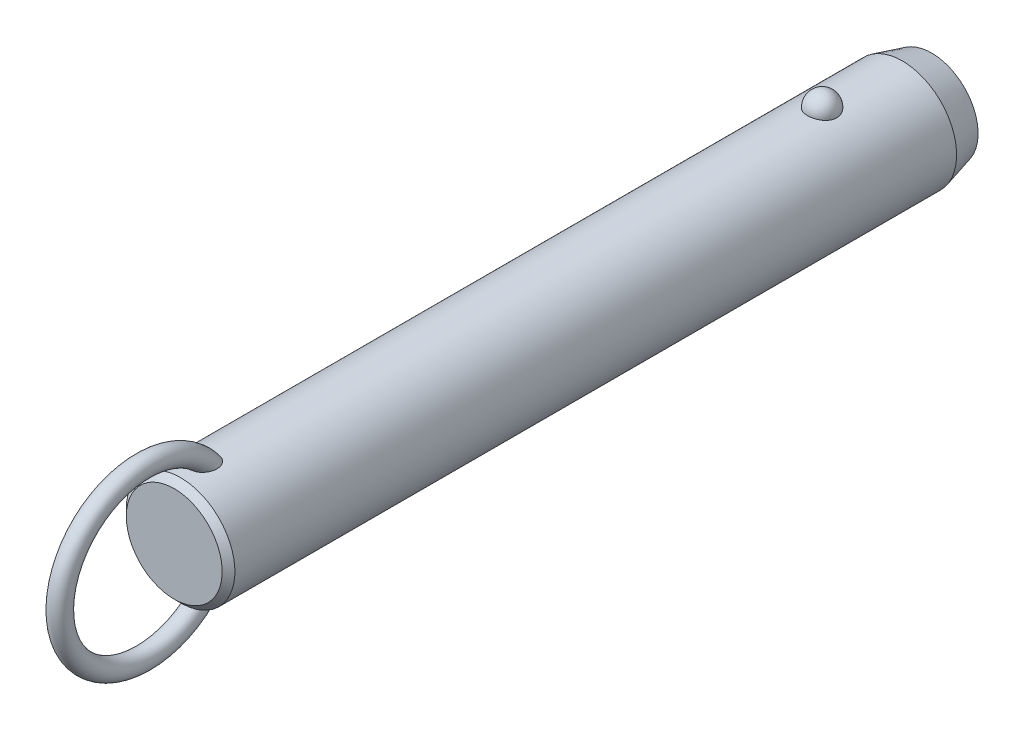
ISO-10303-21;
HEADER;
FILE_DESCRIPTION(('STEP AP214'),'2;1');
FILE_NAME('part.step','',(''),(''),'','','');
FILE_SCHEMA(('AUTOMOTIVE_DESIGN { 1 0 10303 214 1 1 1 1 }'));
ENDSEC;
DATA;
#1=APPLICATION_CONTEXT('core data for automotive mechanical design processes');
#2=APPLICATION_PROTOCOL_DEFINITION('international standard','automotive_design',2000,#1);
#3=PRODUCT_CONTEXT('',#1,'mechanical');
#4=PRODUCT('Part','Part','',(#3));
#5=PRODUCT_RELATED_PRODUCT_CATEGORY('part','',(#4));
#6=PRODUCT_DEFINITION_FORMATION('','',#4);
#7=PRODUCT_DEFINITION_CONTEXT('part definition',#1,'design');
#8=PRODUCT_DEFINITION('design','',#6,#7);
#9=PRODUCT_DEFINITION_SHAPE('','',#8);
#10=(LENGTH_UNIT() NAMED_UNIT(*) SI_UNIT(.MILLI.,.METRE.));
#11=(NAMED_UNIT(*) PLANE_ANGLE_UNIT() SI_UNIT($,.RADIAN.));
#12=(NAMED_UNIT(*) SI_UNIT($,.STERADIAN.) SOLID_ANGLE_UNIT());
#13=UNCERTAINTY_MEASURE_WITH_UNIT(LENGTH_MEASURE(1.E-05),#10,'distance_accuracy_value','');
#14=(GEOMETRIC_REPRESENTATION_CONTEXT(3) GLOBAL_UNCERTAINTY_ASSIGNED_CONTEXT((#13)) GLOBAL_UNIT_ASSIGNED_CONTEXT((#10,
#11,#12)) REPRESENTATION_CONTEXT('',''));
#15=CARTESIAN_POINT('',(0.,0.,0.));
#16=DIRECTION('',(0.,0.,1.));
#17=DIRECTION('',(1.,0.,0.));
#18=AXIS2_PLACEMENT_3D('',#15,#16,#17);
#19=CARTESIAN_POINT('',(0.,0.,116.8));
#20=DIRECTION('',(0.,0.,-1.));
#21=DIRECTION('',(-1.,0.,0.));
#22=AXIS2_PLACEMENT_3D('',#19,#20,#21);
#23=CYLINDRICAL_SURFACE('',#22,11.1);
#24=CARTESIAN_POINT('',(2.9724815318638,10.6945945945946,-3.));
#25=CARTESIAN_POINT('',(2.97247830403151,10.6945972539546,-2.83225059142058));
#26=CARTESIAN_POINT('',(2.95876598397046,10.6984356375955,-2.66445972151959));
#27=CARTESIAN_POINT('',(2.90424529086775,10.7133624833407,-2.33362381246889));
#28=CARTESIAN_POINT('',(2.8634252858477,10.7244540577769,-2.1705808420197));
#29=CARTESIAN_POINT('',(2.75573657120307,10.7526272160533,-1.85396767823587));
#30=CARTESIAN_POINT('',(2.68887937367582,10.7697061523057,-1.70039333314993));
#31=CARTESIAN_POINT('',(2.53079696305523,10.8079438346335,-1.40691598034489));
#32=CARTESIAN_POINT('',(2.43957264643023,10.8291024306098,-1.2670124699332));
#33=CARTESIAN_POINT('',(2.23458150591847,10.8732541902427,-1.00409565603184));
#34=CARTESIAN_POINT('',(2.12071295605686,10.8962553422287,-0.881162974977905));
#35=CARTESIAN_POINT('',(1.87365402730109,10.9414421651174,-0.656352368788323));
#36=CARTESIAN_POINT('',(1.74046358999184,10.9636278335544,-0.554474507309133));
#37=CARTESIAN_POINT('',(1.45872188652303,11.0046495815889,-0.374872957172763));
#38=CARTESIAN_POINT('',(1.31021276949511,11.0234944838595,-0.297085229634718));
#39=CARTESIAN_POINT('',(1.00170030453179,11.0557957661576,-0.167529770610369));
#40=CARTESIAN_POINT('',(0.841698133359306,11.0692526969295,-0.115759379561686));
#41=CARTESIAN_POINT('',(0.517607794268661,11.0890932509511,-0.0403925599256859));
#42=CARTESIAN_POINT('',(0.353633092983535,11.0955916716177,-0.0163383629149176));
#43=CARTESIAN_POINT('',(0.0238420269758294,11.1011989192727,0.0044517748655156));
#44=CARTESIAN_POINT('',(-0.141974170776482,11.1003084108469,0.00119017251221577));
#45=CARTESIAN_POINT('',(-0.468405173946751,11.0912990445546,-0.0323233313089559));
#46=CARTESIAN_POINT('',(-0.629059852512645,11.0832767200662,-0.0622147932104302));
#47=CARTESIAN_POINT('',(-0.942937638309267,11.0609962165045,-0.147645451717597));
#48=CARTESIAN_POINT('',(-1.09616062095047,11.0467379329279,-0.203185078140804));
#49=CARTESIAN_POINT('',(-1.39181061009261,11.0134071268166,-0.3387529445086));
#50=CARTESIAN_POINT('',(-1.53417383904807,10.9943086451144,-0.418913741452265));
#51=CARTESIAN_POINT('',(-1.80342160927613,10.9533667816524,-0.60144882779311));
#52=CARTESIAN_POINT('',(-1.9303046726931,10.9315231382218,-0.703825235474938));
#53=CARTESIAN_POINT('',(-2.16747598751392,10.887005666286,-0.930091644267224));
#54=CARTESIAN_POINT('',(-2.27742774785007,10.8643239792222,-1.05433291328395));
#55=CARTESIAN_POINT('',(-2.47517316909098,10.8209886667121,-1.31966633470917));
#56=CARTESIAN_POINT('',(-2.56296538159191,10.8003351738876,-1.46075958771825));
#57=CARTESIAN_POINT('',(-2.71500300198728,10.7631304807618,-1.75753646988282));
#58=CARTESIAN_POINT('',(-2.77898901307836,10.7466250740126,-1.91335887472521));
#59=CARTESIAN_POINT('',(-2.88046189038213,10.7198747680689,-2.2339152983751));
#60=CARTESIAN_POINT('',(-2.91794947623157,10.709629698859,-2.39864907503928));
#61=CARTESIAN_POINT('',(-2.96537819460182,10.6965949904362,-2.73165170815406));
#62=CARTESIAN_POINT('',(-2.97542891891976,10.693775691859,-2.89990378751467));
#63=CARTESIAN_POINT('',(-2.96804271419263,10.6958279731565,-3.235752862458));
#64=CARTESIAN_POINT('',(-2.95060646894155,10.7006993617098,-3.40334987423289));
#65=CARTESIAN_POINT('',(-2.88883358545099,10.71753912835,-3.73233906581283));
#66=CARTESIAN_POINT('',(-2.84462026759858,10.7294749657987,-3.89375610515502));
#67=CARTESIAN_POINT('',(-2.73050447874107,10.7590797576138,-4.20667949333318));
#68=CARTESIAN_POINT('',(-2.66060103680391,10.7767489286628,-4.35818546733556));
#69=CARTESIAN_POINT('',(-2.49642559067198,10.8159599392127,-4.6478542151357));
#70=CARTESIAN_POINT('',(-2.40203047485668,10.8375211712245,-4.78594458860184));
#71=CARTESIAN_POINT('',(-2.19143488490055,10.8820570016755,-5.0441038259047));
#72=CARTESIAN_POINT('',(-2.07523364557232,10.9050316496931,-5.16417205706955));
#73=CARTESIAN_POINT('',(-1.82361254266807,10.9499219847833,-5.38334833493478));
#74=CARTESIAN_POINT('',(-1.68812945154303,10.9718338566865,-5.48238464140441));
#75=CARTESIAN_POINT('',(-1.40191298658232,11.0120611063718,-5.65618873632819));
#76=CARTESIAN_POINT('',(-1.25118062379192,11.0303767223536,-5.73095813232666));
#77=CARTESIAN_POINT('',(-0.940570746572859,11.0611653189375,-5.85334725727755));
#78=CARTESIAN_POINT('',(-0.780821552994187,11.0737044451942,-5.90127578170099));
#79=CARTESIAN_POINT('',(-0.455204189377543,11.0918598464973,-5.96992976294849));
#80=CARTESIAN_POINT('',(-0.289336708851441,11.0974768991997,-5.99065827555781));
#81=CARTESIAN_POINT('',(0.0406846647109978,11.1011307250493,-6.00418773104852));
#82=CARTESIAN_POINT('',(0.204817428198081,11.099299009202,-5.99747318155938));
#83=CARTESIAN_POINT('',(0.5295530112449,11.088551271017,-5.9574031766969));
#84=CARTESIAN_POINT('',(0.69015594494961,11.0796354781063,-5.92404858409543));
#85=CARTESIAN_POINT('',(1.0027760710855,11.0557204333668,-5.83180084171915));
#86=CARTESIAN_POINT('',(1.15482001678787,11.0407414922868,-5.77299291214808));
#87=CARTESIAN_POINT('',(1.44678373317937,11.0062913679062,-5.63147366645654));
#88=CARTESIAN_POINT('',(1.58670279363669,10.9868199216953,-5.54876095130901));
#89=CARTESIAN_POINT('',(1.8527023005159,10.9451315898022,-5.36027644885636));
#90=CARTESIAN_POINT('',(1.97855158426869,10.9228788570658,-5.25418644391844));
#91=CARTESIAN_POINT('',(2.21080872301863,10.8782509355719,-5.02251354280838));
#92=CARTESIAN_POINT('',(2.31721312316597,10.8558757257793,-4.89692718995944));
#93=CARTESIAN_POINT('',(2.5094551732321,10.8130715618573,-4.62745408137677));
#94=CARTESIAN_POINT('',(2.59493284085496,10.7926798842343,-4.48330448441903));
#95=CARTESIAN_POINT('',(2.740862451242,10.7565495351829,-4.18236358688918));
#96=CARTESIAN_POINT('',(2.80132490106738,10.7408089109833,-4.02557762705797));
#97=CARTESIAN_POINT('',(2.88959070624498,10.7173718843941,-3.72475308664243));
#98=CARTESIAN_POINT('',(2.92062102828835,10.7088950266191,-3.58171216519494));
#99=CARTESIAN_POINT('',(2.96206765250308,10.6975052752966,-3.29245795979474));
#100=CARTESIAN_POINT('',(2.97248434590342,10.6945922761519,-3.14624473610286));
#101=CARTESIAN_POINT('',(2.9724815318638,10.6945945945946,-3.));
#102=B_SPLINE_CURVE_WITH_KNOTS('',3,(#24,#25,#26,#27,#28,#29,#30,#31,#32,#33,#34,#35,#36,#37,
#38,#39,#40,#41,#42,#43,#44,#45,#46,#47,#48,#49,#50,#51,#52,#53,#54,#55,#56,#57,#58,#59,#60,#61,
#62,#63,#64,#65,#66,#67,#68,#69,#70,#71,#72,#73,#74,#75,#76,#77,#78,#79,#80,#81,#82,#83,#84,#85,
#86,#87,#88,#89,#90,#91,#92,#93,#94,#95,#96,#97,#98,#99,#100,#101),.UNSPECIFIED.,.T.,.F.,(4,2,2,
2,2,2,2,2,2,2,2,2,2,2,2,2,2,2,2,2,2,2,2,2,2,2,2,2,2,2,2,2,2,2,2,2,2,2,4),(0.,0.502722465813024,
1.00566079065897,1.5083769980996,2.01107471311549,2.51608392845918,3.02109467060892,
3.52475118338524,4.02835620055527,4.523518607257,5.0186364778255,5.50715297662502,
5.9956776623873,6.48688002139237,6.97812923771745,7.47814366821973,7.9781907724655,
8.48353712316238,8.9888697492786,9.49218093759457,9.99547960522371,10.4964777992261,
10.997494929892,11.5010810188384,12.0046847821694,12.5099796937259,13.0152411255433,
13.5145635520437,14.0138298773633,14.5043200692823,14.9947943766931,15.4836390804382,
15.9725123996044,16.4685040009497,16.9645836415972,17.4686765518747,17.972557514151,
18.410841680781,18.849117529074),.UNSPECIFIED.);
#103=CARTESIAN_POINT('',(2.9724815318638,10.6945945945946,-3.));
#104=VERTEX_POINT('',#103);
#105=EDGE_CURVE('E41',#104,#104,#102,.T.);
#106=ORIENTED_EDGE('',*,*,#105,.T.);
#107=EDGE_LOOP('',(#106));
#108=FACE_BOUND('',#107,.T.);
#109=CARTESIAN_POINT('',(0.,0.,128.2));
#110=DIRECTION('',(0.,0.,1.));
#111=DIRECTION('',(1.,0.,0.));
#112=AXIS2_PLACEMENT_3D('',#109,#110,#111);
#113=CIRCLE('',#112,11.1);
#114=CARTESIAN_POINT('',(-11.1,0.,128.2));
#115=VERTEX_POINT('',#114);
#116=EDGE_CURVE('E10',#115,#115,#113,.F.);
#117=ORIENTED_EDGE('',*,*,#116,.T.);
#118=EDGE_LOOP('',(#117));
#119=FACE_BOUND('',#118,.T.);
#120=CARTESIAN_POINT('',(-0.564520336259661,-11.0856356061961,120.457815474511));
#121=CARTESIAN_POINT('',(-0.66720283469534,-11.0804062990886,120.491283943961));
#122=CARTESIAN_POINT('',(-0.766875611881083,-11.0738877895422,120.533835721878));
#123=CARTESIAN_POINT('',(-0.957284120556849,-11.0590576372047,120.635419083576));
#124=CARTESIAN_POINT('',(-1.04801616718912,-11.0507452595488,120.69445742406));
#125=CARTESIAN_POINT('',(-1.21800952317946,-11.0333016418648,120.826529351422));
#126=CARTESIAN_POINT('',(-1.29730805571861,-11.0241732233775,120.899515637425));
#127=CARTESIAN_POINT('',(-1.44337665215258,-11.0060026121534,121.057037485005));
#128=CARTESIAN_POINT('',(-1.51014622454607,-10.9969604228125,121.141573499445));
#129=CARTESIAN_POINT('',(-1.63454620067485,-10.9791841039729,121.325521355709));
#130=CARTESIAN_POINT('',(-1.69127003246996,-10.9705107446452,121.425549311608));
#131=CARTESIAN_POINT('',(-1.78980785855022,-10.9548648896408,121.632790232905));
#132=CARTESIAN_POINT('',(-1.83161214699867,-10.9478935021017,121.740007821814));
#133=CARTESIAN_POINT('',(-1.91557028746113,-10.9335803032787,122.005408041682));
#134=CARTESIAN_POINT('',(-1.95040620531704,-10.9273269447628,122.165980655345));
#135=CARTESIAN_POINT('',(-1.99388326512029,-10.9194709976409,122.490697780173));
#136=CARTESIAN_POINT('',(-2.00248051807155,-10.9178762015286,122.654847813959));
#137=CARTESIAN_POINT('',(-1.99551615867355,-10.9191578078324,123.024650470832));
#138=CARTESIAN_POINT('',(-1.9732206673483,-10.9232807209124,123.230191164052));
#139=CARTESIAN_POINT('',(-1.9152976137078,-10.9335244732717,123.533595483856));
#140=CARTESIAN_POINT('',(-1.8918457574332,-10.9376266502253,123.634088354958));
#141=CARTESIAN_POINT('',(-1.83700674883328,-10.9469720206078,123.832855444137));
#142=CARTESIAN_POINT('',(-1.80562070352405,-10.9522150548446,123.931129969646));
#143=CARTESIAN_POINT('',(-1.73463055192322,-10.9636837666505,124.125914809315));
#144=CARTESIAN_POINT('',(-1.6949341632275,-10.9699202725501,124.222390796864));
#145=CARTESIAN_POINT('',(-1.6074514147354,-10.9830806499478,124.411626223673));
#146=CARTESIAN_POINT('',(-1.55966150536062,-10.9900048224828,124.504384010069));
#147=CARTESIAN_POINT('',(-1.45591812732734,-11.0042280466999,124.684690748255));
#148=CARTESIAN_POINT('',(-1.40000013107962,-11.0115253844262,124.772260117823));
#149=CARTESIAN_POINT('',(-1.2793747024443,-11.0261911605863,124.941029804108));
#150=CARTESIAN_POINT('',(-1.21467835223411,-11.0335594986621,125.02223795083));
#151=CARTESIAN_POINT('',(-1.08218150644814,-11.0473027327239,125.169001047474));
#152=CARTESIAN_POINT('',(-1.01522633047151,-11.0537063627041,125.235309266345));
#153=CARTESIAN_POINT('',(-0.872952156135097,-11.065850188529,125.358378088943));
#154=CARTESIAN_POINT('',(-0.797642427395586,-11.0715911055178,125.415149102));
#155=CARTESIAN_POINT('',(-0.651396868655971,-11.081071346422,125.507515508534));
#156=CARTESIAN_POINT('',(-0.581712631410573,-11.0849841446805,125.545049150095));
#157=CARTESIAN_POINT('',(-0.437066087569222,-11.0916271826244,125.608259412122));
#158=CARTESIAN_POINT('',(-0.362109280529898,-11.0943586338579,125.633948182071));
#159=CARTESIAN_POINT('',(-0.207828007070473,-11.0983242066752,125.671117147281));
#160=CARTESIAN_POINT('',(-0.128467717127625,-11.0995432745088,125.682454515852));
#161=CARTESIAN_POINT('',(0.03091017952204,-11.1002423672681,125.688965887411));
#162=CARTESIAN_POINT('',(0.11092739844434,-11.0997233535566,125.684148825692));
#163=CARTESIAN_POINT('',(0.256406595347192,-11.097240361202,125.660959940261));
#164=CARTESIAN_POINT('',(0.322235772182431,-11.0955074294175,125.644754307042));
#165=CARTESIAN_POINT('',(0.450635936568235,-11.0910350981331,125.602600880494));
#166=CARTESIAN_POINT('',(0.513205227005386,-11.0882951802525,125.576648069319));
#167=CARTESIAN_POINT('',(0.662626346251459,-11.0805620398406,125.502607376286));
#168=CARTESIAN_POINT('',(0.747127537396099,-11.0751144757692,125.449845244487));
#169=CARTESIAN_POINT('',(0.906756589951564,-11.0631932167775,125.331720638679));
#170=CARTESIAN_POINT('',(0.981859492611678,-11.0567168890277,125.266325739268));
#171=CARTESIAN_POINT('',(1.10712207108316,-11.0447856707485,125.14226337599));
#172=CARTESIAN_POINT('',(1.15909566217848,-11.0394280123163,125.085383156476));
#173=CARTESIAN_POINT('',(1.25791923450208,-11.0286040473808,124.967327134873));
#174=CARTESIAN_POINT('',(1.30476642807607,-11.0231376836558,124.906149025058));
#175=CARTESIAN_POINT('',(1.43818612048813,-11.0068027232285,124.717305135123));
#176=CARTESIAN_POINT('',(1.51751767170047,-10.9960104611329,124.584453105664));
#177=CARTESIAN_POINT('',(1.63597546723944,-10.9788847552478,124.353137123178));
#178=CARTESIAN_POINT('',(1.67988876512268,-10.9722190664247,124.257053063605));
#179=CARTESIAN_POINT('',(1.75953241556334,-10.9597298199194,124.061431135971));
#180=CARTESIAN_POINT('',(1.79525967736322,-10.9539065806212,123.961891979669));
#181=CARTESIAN_POINT('',(1.85844731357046,-10.9433632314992,123.76021118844));
#182=CARTESIAN_POINT('',(1.88591073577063,-10.9386427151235,123.65807052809));
#183=CARTESIAN_POINT('',(1.93234324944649,-10.9305350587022,123.451819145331));
#184=CARTESIAN_POINT('',(1.95131065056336,-10.9271481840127,123.347708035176));
#185=CARTESIAN_POINT('',(1.99040203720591,-10.9201183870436,123.065458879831));
#186=CARTESIAN_POINT('',(2.00221217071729,-10.9179256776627,122.886037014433));
#187=CARTESIAN_POINT('',(1.99711676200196,-10.9188636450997,122.527713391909));
#188=CARTESIAN_POINT('',(1.98026150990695,-10.9219849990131,122.348811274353));
#189=CARTESIAN_POINT('',(1.92151657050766,-10.9324473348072,122.03645144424));
#190=CARTESIAN_POINT('',(1.88605081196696,-10.9386915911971,121.901759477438));
#191=CARTESIAN_POINT('',(1.79393020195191,-10.9541780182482,121.639966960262));
#192=CARTESIAN_POINT('',(1.73729868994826,-10.9634168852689,121.512858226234));
#193=CARTESIAN_POINT('',(1.612370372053,-10.9824218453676,121.289418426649));
#194=CARTESIAN_POINT('',(1.54715374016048,-10.9918945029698,121.191345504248));
#195=CARTESIAN_POINT('',(1.40127026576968,-11.0114415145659,121.007434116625));
#196=CARTESIAN_POINT('',(1.32060742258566,-11.0215157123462,120.921592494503));
#197=CARTESIAN_POINT('',(1.14474787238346,-11.041168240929,120.765163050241));
#198=CARTESIAN_POINT('',(1.04947805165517,-11.0507437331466,120.694656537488));
#199=CARTESIAN_POINT('',(0.847278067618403,-11.0680789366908,120.572640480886));
#200=CARTESIAN_POINT('',(0.74035174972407,-11.0758392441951,120.521124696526));
#201=CARTESIAN_POINT('',(0.529289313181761,-11.0878275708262,120.443485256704));
#202=CARTESIAN_POINT('',(0.425895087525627,-11.0923259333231,120.415377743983));
#203=CARTESIAN_POINT('',(0.215723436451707,-11.0984001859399,120.377703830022));
#204=CARTESIAN_POINT('',(0.108947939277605,-11.0999777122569,120.368127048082));
#205=CARTESIAN_POINT('',(-0.093896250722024,-11.1000196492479,120.367877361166));
#206=CARTESIAN_POINT('',(-0.189967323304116,-11.0987797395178,120.375408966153));
#207=CARTESIAN_POINT('',(-0.379657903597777,-11.0939111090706,120.405507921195));
#208=CARTESIAN_POINT('',(-0.473277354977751,-11.0902823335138,120.428075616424));
#209=CARTESIAN_POINT('',(-0.564520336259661,-11.0856356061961,120.457815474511));
#210=B_SPLINE_CURVE_WITH_KNOTS('',3,(#120,#121,#122,#123,#124,#125,#126,#127,#128,#129,#130,
#131,#132,#133,#134,#135,#136,#137,#138,#139,#140,#141,#142,#143,#144,#145,#146,#147,#148,#149,
#150,#151,#152,#153,#154,#155,#156,#157,#158,#159,#160,#161,#162,#163,#164,#165,#166,#167,#168,
#169,#170,#171,#172,#173,#174,#175,#176,#177,#178,#179,#180,#181,#182,#183,#184,#185,#186,#187,
#188,#189,#190,#191,#192,#193,#194,#195,#196,#197,#198,#199,#200,#201,#202,#203,#204,#205,#206,
#207,#208,#209),.UNSPECIFIED.,.T.,.F.,(4,2,2,2,2,2,2,2,2,2,2,2,2,2,2,2,2,2,2,2,2,2,2,2,2,2,2,2,
2,2,2,2,2,2,2,2,2,2,2,2,2,2,2,2,4),(0.,0.323999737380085,0.648132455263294,0.971184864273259,
1.2942499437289,1.6388623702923,1.98369857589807,2.47426059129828,2.96564271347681,
3.58257396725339,3.89215258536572,4.201688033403,4.51486273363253,4.82817514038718,
5.14015911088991,5.45175282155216,5.73442856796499,6.01679375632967,6.2536458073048,
6.49025437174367,6.72919963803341,6.96801276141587,7.17061258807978,7.37331685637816,
7.67094989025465,7.96935728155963,8.20075067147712,8.43226927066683,8.89581623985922,
9.21306533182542,9.530434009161,9.84768549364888,10.1650000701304,10.70229304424,
11.2386443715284,11.6553390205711,12.0715755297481,12.4245637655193,12.7774607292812,
13.1321855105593,13.4867936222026,13.8068771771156,14.1267813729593,14.4146787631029,
14.7025827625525),.UNSPECIFIED.);
#211=CARTESIAN_POINT('',(-0.564520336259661,-11.0856356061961,120.457815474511));
#212=VERTEX_POINT('',#211);
#213=EDGE_CURVE('E60',#212,#212,#210,.T.);
#214=ORIENTED_EDGE('',*,*,#213,.T.);
#215=EDGE_LOOP('',(#214));
#216=FACE_BOUND('',#215,.T.);
#217=CARTESIAN_POINT('',(-0.564520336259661,11.0856356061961,120.457815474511));
#218=CARTESIAN_POINT('',(-0.468542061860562,11.0905203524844,120.426545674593));
#219=CARTESIAN_POINT('',(-0.36979381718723,11.0942886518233,120.403157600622));
#220=CARTESIAN_POINT('',(-0.169555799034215,11.0991586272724,120.373085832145));
#221=CARTESIAN_POINT('',(-0.0680604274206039,11.1002543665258,120.36643932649));
#222=CARTESIAN_POINT('',(0.134549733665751,11.099646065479,120.370157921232));
#223=CARTESIAN_POINT('',(0.235664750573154,11.0979441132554,120.38051033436));
#224=CARTESIAN_POINT('',(0.434632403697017,11.0919342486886,120.417831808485));
#225=CARTESIAN_POINT('',(0.532486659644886,11.0876276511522,120.444792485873));
#226=CARTESIAN_POINT('',(0.722445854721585,11.0768742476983,120.5144096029));
#227=CARTESIAN_POINT('',(0.814543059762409,11.0704246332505,120.557086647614));
#228=CARTESIAN_POINT('',(0.990565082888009,11.0560659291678,120.656648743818));
#229=CARTESIAN_POINT('',(1.07448844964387,11.048156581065,120.713536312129));
#230=CARTESIAN_POINT('',(1.23562672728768,11.0313221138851,120.842210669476));
#231=CARTESIAN_POINT('',(1.31242684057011,11.0223686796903,120.914511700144));
#232=CARTESIAN_POINT('',(1.45398030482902,11.0045918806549,121.070042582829));
#233=CARTESIAN_POINT('',(1.51873073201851,10.9957685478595,121.153275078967));
#234=CARTESIAN_POINT('',(1.64107232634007,10.9782087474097,121.336384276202));
#235=CARTESIAN_POINT('',(1.69743176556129,10.9695572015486,121.437089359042));
#236=CARTESIAN_POINT('',(1.79515063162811,10.9539887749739,121.645626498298));
#237=CARTESIAN_POINT('',(1.83649966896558,10.9470730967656,121.75346343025));
#238=CARTESIAN_POINT('',(1.91931148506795,10.9329211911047,122.020399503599));
#239=CARTESIAN_POINT('',(1.95340104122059,10.9267904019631,122.181861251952));
#240=CARTESIAN_POINT('',(1.99526195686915,10.9192174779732,122.50821631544));
#241=CARTESIAN_POINT('',(2.00298989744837,10.9177830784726,122.67311484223));
#242=CARTESIAN_POINT('',(1.9939625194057,10.9194420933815,123.044100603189));
#243=CARTESIAN_POINT('',(1.97050829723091,10.923774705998,123.25003871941));
#244=CARTESIAN_POINT('',(1.91079643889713,10.9343131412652,123.553901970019));
#245=CARTESIAN_POINT('',(1.88673702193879,10.9385106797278,123.654529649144));
#246=CARTESIAN_POINT('',(1.83065508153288,10.9480376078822,123.853510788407));
#247=CARTESIAN_POINT('',(1.79863369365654,10.9533668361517,123.951864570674));
#248=CARTESIAN_POINT('',(1.72633365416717,10.9649954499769,124.146720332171));
#249=CARTESIAN_POINT('',(1.68596409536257,10.9713053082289,124.24318790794));
#250=CARTESIAN_POINT('',(1.5970799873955,10.9845964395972,124.432323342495));
#251=CARTESIAN_POINT('',(1.54856169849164,10.9915780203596,124.524989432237));
#252=CARTESIAN_POINT('',(1.44330168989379,11.0058935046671,124.704975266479));
#253=CARTESIAN_POINT('',(1.38659749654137,11.0132257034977,124.792316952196));
#254=CARTESIAN_POINT('',(1.26431158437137,11.0279330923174,124.960456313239));
#255=CARTESIAN_POINT('',(1.19874160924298,11.0353082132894,125.041262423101));
#256=CARTESIAN_POINT('',(1.06542088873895,11.048931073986,125.185985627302));
#257=CARTESIAN_POINT('',(0.998640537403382,11.0552153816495,125.250784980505));
#258=CARTESIAN_POINT('',(0.856896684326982,11.0671032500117,125.370846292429));
#259=CARTESIAN_POINT('',(0.781942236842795,11.0727075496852,125.426118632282));
#260=CARTESIAN_POINT('',(0.636276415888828,11.081949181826,125.515972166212));
#261=CARTESIAN_POINT('',(0.566755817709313,11.0857572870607,125.552441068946));
#262=CARTESIAN_POINT('',(0.422602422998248,11.0921860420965,125.613533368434));
#263=CARTESIAN_POINT('',(0.347974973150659,11.0948079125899,125.638168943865));
#264=CARTESIAN_POINT('',(0.194593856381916,11.0985608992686,125.673323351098));
#265=CARTESIAN_POINT('',(0.115807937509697,11.0996777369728,125.683706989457));
#266=CARTESIAN_POINT('',(-0.0422499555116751,11.1002003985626,125.688574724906));
#267=CARTESIAN_POINT('',(-0.121521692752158,11.09960699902,125.683066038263));
#268=CARTESIAN_POINT('',(-0.266046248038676,11.0970123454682,125.658827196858));
#269=CARTESIAN_POINT('',(-0.331661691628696,11.0952283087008,125.642135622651));
#270=CARTESIAN_POINT('',(-0.459588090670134,11.0906663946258,125.599111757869));
#271=CARTESIAN_POINT('',(-0.521897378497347,11.0878880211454,125.572774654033));
#272=CARTESIAN_POINT('',(-0.671446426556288,11.0800342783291,125.497513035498));
#273=CARTESIAN_POINT('',(-0.756250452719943,11.0744969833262,125.443818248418));
#274=CARTESIAN_POINT('',(-0.916349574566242,11.0624045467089,125.323802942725));
#275=CARTESIAN_POINT('',(-0.991618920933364,11.0558467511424,125.257449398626));
#276=CARTESIAN_POINT('',(-1.11713140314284,11.0437783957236,125.131633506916));
#277=CARTESIAN_POINT('',(-1.16920539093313,11.0383619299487,125.073952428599));
#278=CARTESIAN_POINT('',(-1.26817476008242,11.02743010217,124.954280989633));
#279=CARTESIAN_POINT('',(-1.315067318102,11.0219146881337,124.892288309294));
#280=CARTESIAN_POINT('',(-1.40399813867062,11.0109399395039,124.764784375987));
#281=CARTESIAN_POINT('',(-1.44602864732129,11.0054807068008,124.699267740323));
#282=CARTESIAN_POINT('',(-1.52538779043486,10.9947621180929,124.565422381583));
#283=CARTESIAN_POINT('',(-1.56271516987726,10.9895028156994,124.497092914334));
#284=CARTESIAN_POINT('',(-1.64537943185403,10.9774790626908,124.333210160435));
#285=CARTESIAN_POINT('',(-1.68879497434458,10.9708503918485,124.2366735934));
#286=CARTESIAN_POINT('',(-1.76740738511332,10.9584602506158,124.040236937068));
#287=CARTESIAN_POINT('',(-1.80260120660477,10.95269910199,123.94033561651));
#288=CARTESIAN_POINT('',(-1.86468657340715,10.9423003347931,123.737966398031));
#289=CARTESIAN_POINT('',(-1.89158164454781,10.9376622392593,123.635499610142));
#290=CARTESIAN_POINT('',(-1.93682458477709,10.9297405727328,123.428642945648));
#291=CARTESIAN_POINT('',(-1.9551708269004,10.9264572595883,123.324252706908));
#292=CARTESIAN_POINT('',(-1.99232562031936,10.9197647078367,123.04262876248));
#293=CARTESIAN_POINT('',(-2.00294603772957,10.9177914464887,122.864185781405));
#294=CARTESIAN_POINT('',(-1.99566675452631,10.9191290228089,122.507996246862));
#295=CARTESIAN_POINT('',(-1.97781651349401,10.9224306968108,122.33024902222));
#296=CARTESIAN_POINT('',(-1.91747214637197,10.9331592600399,122.019792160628));
#297=CARTESIAN_POINT('',(-1.88131022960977,10.9395108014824,121.885825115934));
#298=CARTESIAN_POINT('',(-1.7879038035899,10.9551659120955,121.62559757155));
#299=CARTESIAN_POINT('',(-1.7306830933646,10.9644661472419,121.499328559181));
#300=CARTESIAN_POINT('',(-1.60475573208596,10.9835398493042,121.27741565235));
#301=CARTESIAN_POINT('',(-1.53908879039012,10.9930297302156,121.180026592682));
#302=CARTESIAN_POINT('',(-1.39238608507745,11.0125708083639,120.997525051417));
#303=CARTESIAN_POINT('',(-1.31135150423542,11.0226219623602,120.912411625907));
#304=CARTESIAN_POINT('',(-1.14382035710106,11.0411991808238,120.76529943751));
#305=CARTESIAN_POINT('',(-1.05858500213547,11.0497792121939,120.70186930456));
#306=CARTESIAN_POINT('',(-0.878723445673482,11.0655285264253,120.590250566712));
#307=CARTESIAN_POINT('',(-0.784123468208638,11.0727015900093,120.542020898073));
#308=CARTESIAN_POINT('',(-0.646163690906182,11.0812501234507,120.486023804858));
#309=CARTESIAN_POINT('',(-0.605595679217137,11.0835451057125,120.471197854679));
#310=CARTESIAN_POINT('',(-0.564520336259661,11.0856356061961,120.457815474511));
#311=B_SPLINE_CURVE_WITH_KNOTS('',3,(#217,#218,#219,#220,#221,#222,#223,#224,#225,#226,#227,
#228,#229,#230,#231,#232,#233,#234,#235,#236,#237,#238,#239,#240,#241,#242,#243,#244,#245,#246,
#247,#248,#249,#250,#251,#252,#253,#254,#255,#256,#257,#258,#259,#260,#261,#262,#263,#264,#265,
#266,#267,#268,#269,#270,#271,#272,#273,#274,#275,#276,#277,#278,#279,#280,#281,#282,#283,#284,
#285,#286,#287,#288,#289,#290,#291,#292,#293,#294,#295,#296,#297,#298,#299,#300,#301,#302,#303,
#304,#305,#306,#307,#308,#309,#310),.UNSPECIFIED.,.T.,.F.,(4,2,2,2,2,2,2,2,2,2,2,2,2,2,2,2,2,2,
2,2,2,2,2,2,2,2,2,2,2,2,2,2,2,2,2,2,2,2,2,2,2,2,2,2,2,2,4),(0.,0.303061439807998,
0.606795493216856,0.910302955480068,1.21365733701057,1.51741085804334,1.82121821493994,
2.13745205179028,2.45376252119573,2.79958678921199,3.14564996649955,3.63832391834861,
4.13180893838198,4.75031912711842,5.06071926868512,5.37107516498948,5.68500772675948,
5.99908475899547,6.31176519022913,6.62403542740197,6.90315673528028,7.18197194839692,
7.41687778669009,7.65154134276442,7.88841587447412,8.12518286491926,8.32752842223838,
8.5299750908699,8.82986421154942,9.13054668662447,9.36393502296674,9.59744991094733,
9.83133221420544,10.0652767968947,10.383032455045,10.7009056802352,11.0186436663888,
11.3364420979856,11.8705925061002,12.4038159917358,12.8189662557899,13.2336487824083,
13.5857049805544,13.9377340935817,14.2561354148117,14.5736690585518,14.7033687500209),.UNSPECIFIED.);
#312=CARTESIAN_POINT('',(-0.564520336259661,11.0856356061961,120.457815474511));
#313=VERTEX_POINT('',#312);
#314=EDGE_CURVE('E68',#313,#313,#311,.T.);
#315=ORIENTED_EDGE('',*,*,#314,.T.);
#316=EDGE_LOOP('',(#315));
#317=FACE_BOUND('',#316,.T.);
#318=CARTESIAN_POINT('',(0.,0.,-19.3999999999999));
#319=DIRECTION('',(0.,0.,-1.));
#320=DIRECTION('',(-1.,0.,0.));
#321=AXIS2_PLACEMENT_3D('',#318,#319,#320);
#322=CIRCLE('',#321,11.1);
#323=CARTESIAN_POINT('',(-11.1,0.,-19.3999999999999));
#324=VERTEX_POINT('',#323);
#325=EDGE_CURVE('E57',#324,#324,#322,.F.);
#326=ORIENTED_EDGE('',*,*,#325,.T.);
#327=EDGE_LOOP('',(#326));
#328=FACE_BOUND('',#327,.T.);
#329=ADVANCED_FACE('F37',(#108,#119,#216,#317,#328),#23,.T.);
#330=CARTESIAN_POINT('',(0.,0.,-25.4));
#331=DIRECTION('',(0.,0.,-1.));
#332=DIRECTION('',(-1.,0.,0.));
#333=AXIS2_PLACEMENT_3D('',#330,#331,#332);
#334=PLANE('',#333);
#335=CARTESIAN_POINT('',(0.,0.,-25.4));
#336=DIRECTION('',(0.,0.,-1.));
#337=DIRECTION('',(-1.,0.,0.));
#338=AXIS2_PLACEMENT_3D('',#335,#336,#337);
#339=CIRCLE('',#338,9.49230484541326);
#340=CARTESIAN_POINT('',(-9.49230484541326,0.,-25.4));
#341=VERTEX_POINT('',#340);
#342=EDGE_CURVE('E67',#341,#341,#339,.T.);
#343=ORIENTED_EDGE('',*,*,#342,.T.);
#344=EDGE_LOOP('',(#343));
#345=FACE_BOUND('',#344,.T.);
#346=ADVANCED_FACE('F86',(#345),#334,.T.);
#347=CARTESIAN_POINT('',(0.,0.,-25.4));
#348=DIRECTION('',(0.,0.,1.));
#349=DIRECTION('',(1.,0.,0.));
#350=AXIS2_PLACEMENT_3D('',#347,#348,#349);
#351=CONICAL_SURFACE('',#350,9.49230484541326,0.261799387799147);
#352=ORIENTED_EDGE('',*,*,#325,.F.);
#353=EDGE_LOOP('',(#352));
#354=FACE_BOUND('',#353,.T.);
#355=ORIENTED_EDGE('',*,*,#342,.F.);
#356=EDGE_LOOP('',(#355));
#357=FACE_BOUND('',#356,.T.);
#358=ADVANCED_FACE('F84',(#354,#357),#351,.T.);
#359=CARTESIAN_POINT('',(0.,0.,129.5));
#360=DIRECTION('',(0.,0.,1.));
#361=DIRECTION('',(1.,0.,0.));
#362=AXIS2_PLACEMENT_3D('',#359,#360,#361);
#363=PLANE('',#362);
#364=CARTESIAN_POINT('',(0.,0.,129.5));
#365=DIRECTION('',(0.,0.,1.));
#366=DIRECTION('',(1.,0.,0.));
#367=AXIS2_PLACEMENT_3D('',#364,#365,#366);
#368=CIRCLE('',#367,9.8);
#369=CARTESIAN_POINT('',(-9.80000000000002,0.,129.5));
#370=VERTEX_POINT('',#369);
#371=EDGE_CURVE('E50',#370,#370,#368,.T.);
#372=ORIENTED_EDGE('',*,*,#371,.T.);
#373=EDGE_LOOP('',(#372));
#374=FACE_BOUND('',#373,.T.);
#375=ADVANCED_FACE('F78',(#374),#363,.T.);
#376=CARTESIAN_POINT('',(0.,0.,135.85));
#377=DIRECTION('',(1.,0.,0.));
#378=DIRECTION('',(0.,0.,-1.));
#379=AXIS2_PLACEMENT_3D('',#376,#377,#378);
#380=TOROIDAL_SURFACE('',#379,17.05,2.);
#381=ORIENTED_EDGE('',*,*,#314,.F.);
#382=EDGE_LOOP('',(#381));
#383=FACE_BOUND('',#382,.T.);
#384=ORIENTED_EDGE('',*,*,#213,.F.);
#385=EDGE_LOOP('',(#384));
#386=FACE_BOUND('',#385,.T.);
#387=ADVANCED_FACE('F74',(#383,#386),#380,.T.);
#388=CARTESIAN_POINT('',(0.,0.,129.5));
#389=DIRECTION('',(0.,0.,-1.));
#390=DIRECTION('',(-1.,0.,0.));
#391=AXIS2_PLACEMENT_3D('',#388,#389,#390);
#392=CONICAL_SURFACE('',#391,9.8,0.785398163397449);
#393=CARTESIAN_POINT('',(-11.1,0.,128.2));
#394=CARTESIAN_POINT('',(-11.0864583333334,0.,128.213541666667));
#395=CARTESIAN_POINT('',(-11.0729166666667,0.,128.227083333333));
#396=CARTESIAN_POINT('',(-11.0458333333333,0.,128.254166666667));
#397=CARTESIAN_POINT('',(-11.0322916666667,0.,128.267708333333));
#398=CARTESIAN_POINT('',(-11.0052083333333,0.,128.294791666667));
#399=CARTESIAN_POINT('',(-10.9916666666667,0.,128.308333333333));
#400=CARTESIAN_POINT('',(-10.9645833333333,0.,128.335416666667));
#401=CARTESIAN_POINT('',(-10.9510416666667,0.,128.348958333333));
#402=CARTESIAN_POINT('',(-10.9239583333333,0.,128.376041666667));
#403=CARTESIAN_POINT('',(-10.9104166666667,0.,128.389583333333));
#404=CARTESIAN_POINT('',(-10.8833333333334,0.,128.416666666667));
#405=CARTESIAN_POINT('',(-10.8697916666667,0.,128.430208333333));
#406=CARTESIAN_POINT('',(-10.8427083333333,0.,128.457291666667));
#407=CARTESIAN_POINT('',(-10.8291666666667,0.,128.470833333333));
#408=CARTESIAN_POINT('',(-10.8020833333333,0.,128.497916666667));
#409=CARTESIAN_POINT('',(-10.7885416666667,0.,128.511458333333));
#410=CARTESIAN_POINT('',(-10.7614583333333,0.,128.538541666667));
#411=CARTESIAN_POINT('',(-10.7479166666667,0.,128.552083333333));
#412=CARTESIAN_POINT('',(-10.7208333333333,0.,128.579166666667));
#413=CARTESIAN_POINT('',(-10.7072916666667,0.,128.592708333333));
#414=CARTESIAN_POINT('',(-10.6802083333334,0.,128.619791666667));
#415=CARTESIAN_POINT('',(-10.6666666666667,0.,128.633333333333));
#416=CARTESIAN_POINT('',(-10.6395833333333,0.,128.660416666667));
#417=CARTESIAN_POINT('',(-10.6260416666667,0.,128.673958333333));
#418=CARTESIAN_POINT('',(-10.5989583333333,0.,128.701041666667));
#419=CARTESIAN_POINT('',(-10.5854166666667,0.,128.714583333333));
#420=CARTESIAN_POINT('',(-10.5583333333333,0.,128.741666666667));
#421=CARTESIAN_POINT('',(-10.5447916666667,0.,128.755208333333));
#422=CARTESIAN_POINT('',(-10.5177083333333,0.,128.782291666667));
#423=CARTESIAN_POINT('',(-10.5041666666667,0.,128.795833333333));
#424=CARTESIAN_POINT('',(-10.4770833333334,0.,128.822916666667));
#425=CARTESIAN_POINT('',(-10.4635416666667,0.,128.836458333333));
#426=CARTESIAN_POINT('',(-10.4364583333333,0.,128.863541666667));
#427=CARTESIAN_POINT('',(-10.4229166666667,0.,128.877083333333));
#428=CARTESIAN_POINT('',(-10.3958333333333,0.,128.904166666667));
#429=CARTESIAN_POINT('',(-10.3822916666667,0.,128.917708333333));
#430=CARTESIAN_POINT('',(-10.3552083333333,0.,128.944791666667));
#431=CARTESIAN_POINT('',(-10.3416666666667,0.,128.958333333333));
#432=CARTESIAN_POINT('',(-10.3145833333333,0.,128.985416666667));
#433=CARTESIAN_POINT('',(-10.3010416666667,0.,128.998958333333));
#434=CARTESIAN_POINT('',(-10.2739583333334,0.,129.026041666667));
#435=CARTESIAN_POINT('',(-10.2604166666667,0.,129.039583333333));
#436=CARTESIAN_POINT('',(-10.2333333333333,0.,129.066666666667));
#437=CARTESIAN_POINT('',(-10.2197916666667,0.,129.080208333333));
#438=CARTESIAN_POINT('',(-10.1927083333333,0.,129.107291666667));
#439=CARTESIAN_POINT('',(-10.1791666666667,0.,129.120833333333));
#440=CARTESIAN_POINT('',(-10.1520833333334,0.,129.147916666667));
#441=CARTESIAN_POINT('',(-10.1385416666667,0.,129.161458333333));
#442=CARTESIAN_POINT('',(-10.1114583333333,0.,129.188541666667));
#443=CARTESIAN_POINT('',(-10.0979166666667,0.,129.202083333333));
#444=CARTESIAN_POINT('',(-10.0708333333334,0.,129.229166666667));
#445=CARTESIAN_POINT('',(-10.0572916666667,0.,129.242708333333));
#446=CARTESIAN_POINT('',(-10.0302083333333,0.,129.269791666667));
#447=CARTESIAN_POINT('',(-10.0166666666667,0.,129.283333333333));
#448=CARTESIAN_POINT('',(-9.98958333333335,0.,129.310416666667));
#449=CARTESIAN_POINT('',(-9.97604166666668,0.,129.323958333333));
#450=CARTESIAN_POINT('',(-9.94895833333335,0.,129.351041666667));
#451=CARTESIAN_POINT('',(-9.93541666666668,0.,129.364583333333));
#452=CARTESIAN_POINT('',(-9.90833333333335,0.,129.391666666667));
#453=CARTESIAN_POINT('',(-9.89479166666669,0.,129.405208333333));
#454=CARTESIAN_POINT('',(-9.86770833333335,0.,129.432291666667));
#455=CARTESIAN_POINT('',(-9.85416666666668,0.,129.445833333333));
#456=CARTESIAN_POINT('',(-9.82708333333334,0.,129.472916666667));
#457=CARTESIAN_POINT('',(-9.81354166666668,0.,129.486458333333));
#458=CARTESIAN_POINT('',(-9.80000000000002,0.,129.5));
#459=B_SPLINE_CURVE_WITH_KNOTS('',3,(#393,#394,#395,#396,#397,#398,#399,#400,#401,#402,#403,
#404,#405,#406,#407,#408,#409,#410,#411,#412,#413,#414,#415,#416,#417,#418,#419,#420,#421,#422,
#423,#424,#425,#426,#427,#428,#429,#430,#431,#432,#433,#434,#435,#436,#437,#438,#439,#440,#441,
#442,#443,#444,#445,#446,#447,#448,#449,#450,#451,#452,#453,#454,#455,#456,#457,#458),
.UNSPECIFIED.,.F.,.F.,(4,2,2,2,2,2,2,2,2,2,2,2,2,2,2,2,2,2,2,2,2,2,2,2,2,2,2,2,2,2,2,2,4),(0.,
0.0574524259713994,0.114904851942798,0.172357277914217,0.229809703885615,0.287262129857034,
0.344714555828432,0.402166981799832,0.459619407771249,0.517071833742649,0.574524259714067,
0.631976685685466,0.689429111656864,0.746881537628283,0.804333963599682,0.861786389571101,
0.9192388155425,0.976691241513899,1.03414366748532,1.09159609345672,1.14904851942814,
1.20650094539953,1.26395337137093,1.32140579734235,1.37885822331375,1.43631064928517,
1.49376307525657,1.55121550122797,1.60866792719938,1.66612035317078,1.7235727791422,
1.7810252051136,1.83847763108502),.UNSPECIFIED.);
#460=EDGE_CURVE('BSEAM39',#115,#370,#459,.T.);
#461=ORIENTED_EDGE('',*,*,#116,.F.);
#462=ORIENTED_EDGE('',*,*,#371,.F.);
#463=ORIENTED_EDGE('',*,*,#460,.T.);
#464=ORIENTED_EDGE('',*,*,#460,.F.);
#465=EDGE_LOOP('',(#461,#463,#462,#464));
#466=FACE_BOUND('',#465,.T.);
#467=ADVANCED_FACE('F39',(#466),#392,.T.);
#468=CARTESIAN_POINT('',(0.,11.1,-3.));
#469=DIRECTION('',(0.,1.,0.));
#470=DIRECTION('',(0.,0.,-1.));
#471=AXIS2_PLACEMENT_3D('',#468,#469,#470);
#472=SPHERICAL_SURFACE('',#471,3.);
#473=ORIENTED_EDGE('',*,*,#105,.F.);
#474=EDGE_LOOP('',(#473));
#475=FACE_BOUND('',#474,.T.);
#476=ADVANCED_FACE('F80',(#475),#472,.T.);
#477=CLOSED_SHELL('',(#329,#346,#358,#375,#387,#467,#476));
#478=MANIFOLD_SOLID_BREP('B2',#477);
#479=ADVANCED_BREP_SHAPE_REPRESENTATION('',(#18,#478),#14);
#480=SHAPE_DEFINITION_REPRESENTATION(#9,#479);
ENDSEC;
END-ISO-10303-21;
